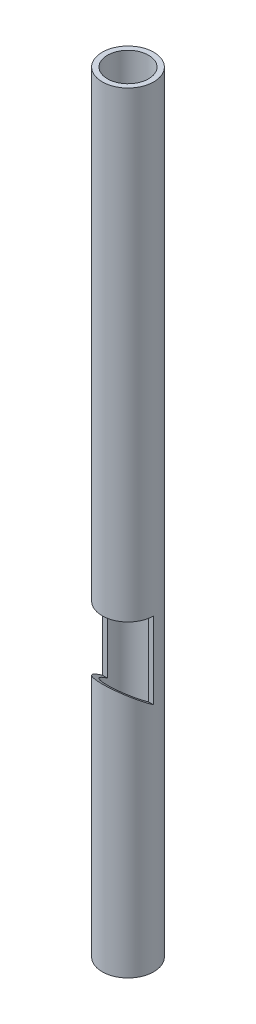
from build123d import *

# Parameters (mm, degrees)
SKETCH1_R                           = 16.7
SKETCH1_R_2                         = 13.32
EXTRUDE1_DEPTH                      = 500
CUT_EXTRUDE1_REACH                  = 502.557
CUT_EXTRUDE1_END_RADIUS             = 16.7
CUT_EXTRUDE1_DIRECTION_2_REACH      = 502.557
CUT_EXTRUDE1_DIRECTION_2_END_RADIUS = 16.7


with BuildPart() as part:
    # Sketch1 → Extrude1 (new body)
    with BuildSketch(Plane(origin=(0, 0, 0), x_dir=(1, 0, 0), z_dir=(0, 1, 0))):
        with Locations(Location((0, 0, 0), (0, 0, 270))):
            Circle(SKETCH1_R)
        with Locations(Location((0, 0, 0), (0, 0, 270))):
            Circle(SKETCH1_R_2, mode=Mode.SUBTRACT)
    extrude(amount=EXTRUDE1_DEPTH)

    # Cut-Extrude1: up to this cylinder (the profile starts inside it)
    cut_extrude1_end = Plane(origin=(0, 178.310993, 0), z_dir=(0, -1, 0)) * Cylinder(CUT_EXTRUDE1_END_RADIUS, 1039.514, mode=Mode.PRIVATE)
    # Sketch2 → Cut-Extrude1 (cut, up to the surface)
    with BuildSketch(Plane(origin=(0, 0, 0), x_dir=(0, 0, -1), z_dir=(1, 0, 0)), mode=Mode.PRIVATE) as cut_extrude1_sk1:
        Polygon((-20, 200), (0, 200), (0, 150), (-20, 164.004150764), align=None)
    cut_extrude1_tool1 = extrude(cut_extrude1_sk1.sketch, amount=-CUT_EXTRUDE1_REACH, mode=Mode.PRIVATE) & cut_extrude1_end
    add(cut_extrude1_tool1.solids().sort_by_distance((0, 178.310993, 9.457177))[0], mode=Mode.SUBTRACT)

    # Cut-Extrude1 direction 2: up to this cylinder (the profile starts inside it)
    cut_extrude1_direction_2_end = Plane(origin=(0, 178.310993, 0), z_dir=(0, -1, 0)) * Cylinder(CUT_EXTRUDE1_DIRECTION_2_END_RADIUS, 1039.514, mode=Mode.PRIVATE)
    # Sketch2 → Cut-Extrude1 direction 2 (cut, up to the surface)
    with BuildSketch(Plane(origin=(0, 0, 0), x_dir=(0, 0, -1), z_dir=(1, 0, 0)), mode=Mode.PRIVATE) as cut_extrude1_direction_2_sk1:
        Polygon((-20, 200), (0, 200), (0, 150), (-20, 164.004150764), align=None)
    cut_extrude1_direction_2_tool1 = extrude(cut_extrude1_direction_2_sk1.sketch, amount=CUT_EXTRUDE1_DIRECTION_2_REACH, mode=Mode.PRIVATE) & cut_extrude1_direction_2_end
    add(cut_extrude1_direction_2_tool1.solids().sort_by_distance((0, 178.310993, 9.457177))[0], mode=Mode.SUBTRACT)


solid = part.part
